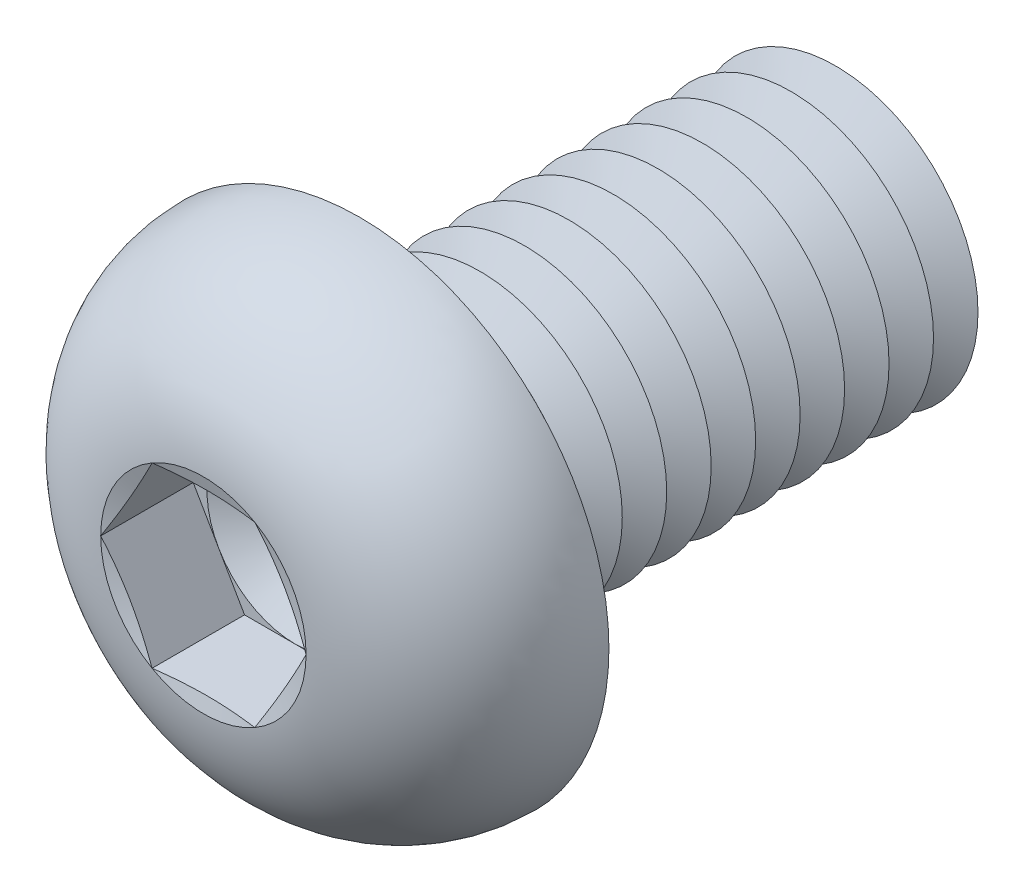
ISO-10303-21;
HEADER;
FILE_DESCRIPTION(('STEP AP214'),'2;1');
FILE_NAME('part.step','',(''),(''),'','','');
FILE_SCHEMA(('AUTOMOTIVE_DESIGN { 1 0 10303 214 1 1 1 1 }'));
ENDSEC;
DATA;
#1=APPLICATION_CONTEXT('core data for automotive mechanical design processes');
#2=APPLICATION_PROTOCOL_DEFINITION('international standard','automotive_design',2000,#1);
#3=PRODUCT_CONTEXT('',#1,'mechanical');
#4=PRODUCT('Part','Part','',(#3));
#5=PRODUCT_RELATED_PRODUCT_CATEGORY('part','',(#4));
#6=PRODUCT_DEFINITION_FORMATION('','',#4);
#7=PRODUCT_DEFINITION_CONTEXT('part definition',#1,'design');
#8=PRODUCT_DEFINITION('design','',#6,#7);
#9=PRODUCT_DEFINITION_SHAPE('','',#8);
#10=(LENGTH_UNIT() NAMED_UNIT(*) SI_UNIT(.MILLI.,.METRE.));
#11=(NAMED_UNIT(*) PLANE_ANGLE_UNIT() SI_UNIT($,.RADIAN.));
#12=(NAMED_UNIT(*) SI_UNIT($,.STERADIAN.) SOLID_ANGLE_UNIT());
#13=UNCERTAINTY_MEASURE_WITH_UNIT(LENGTH_MEASURE(1.E-05),#10,'distance_accuracy_value','');
#14=(GEOMETRIC_REPRESENTATION_CONTEXT(3) GLOBAL_UNCERTAINTY_ASSIGNED_CONTEXT((#13)) GLOBAL_UNIT_ASSIGNED_CONTEXT((#10,
#11,#12)) REPRESENTATION_CONTEXT('',''));
#15=CARTESIAN_POINT('',(0.,0.,0.));
#16=DIRECTION('',(0.,0.,1.));
#17=DIRECTION('',(1.,0.,0.));
#18=AXIS2_PLACEMENT_3D('',#15,#16,#17);
#19=CARTESIAN_POINT('',(0.,0.,1.8));
#20=DIRECTION('',(0.,0.,1.));
#21=DIRECTION('',(1.,0.,0.));
#22=AXIS2_PLACEMENT_3D('',#19,#20,#21);
#23=PLANE('',#22);
#24=CARTESIAN_POINT('',(0.,0.,1.8));
#25=DIRECTION('',(0.,0.,1.));
#26=DIRECTION('',(1.,0.,0.));
#27=AXIS2_PLACEMENT_3D('',#24,#25,#26);
#28=CIRCLE('',#27,2.49999883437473);
#29=CARTESIAN_POINT('',(2.1650625,1.24999941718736,1.8));
#30=VERTEX_POINT('',#29);
#31=CARTESIAN_POINT('',(0.,2.49999883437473,1.8));
#32=VERTEX_POINT('',#31);
#33=EDGE_CURVE('E118',#30,#32,#28,.T.);
#34=ORIENTED_EDGE('',*,*,#33,.F.);
#35=DIRECTION('',(-0.5,0.866025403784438,0.));
#36=VECTOR('',#35,1.);
#37=CARTESIAN_POINT('',(2.88675,0.,1.8));
#38=LINE('',#37,#36);
#39=CARTESIAN_POINT('',(1.443375,2.49999883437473,1.8));
#40=VERTEX_POINT('',#39);
#41=EDGE_CURVE('E125',#30,#40,#38,.T.);
#42=ORIENTED_EDGE('',*,*,#41,.T.);
#43=DIRECTION('',(-1.,0.,0.));
#44=VECTOR('',#43,1.);
#45=CARTESIAN_POINT('',(1.443375,2.49999883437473,1.8));
#46=LINE('',#45,#44);
#47=EDGE_CURVE('E136',#40,#32,#46,.T.);
#48=ORIENTED_EDGE('',*,*,#47,.T.);
#49=EDGE_LOOP('',(#34,#42,#48));
#50=FACE_BOUND('',#49,.T.);
#51=ADVANCED_FACE('F39',(#50),#23,.T.);
#52=CARTESIAN_POINT('',(0.,0.,1.8));
#53=DIRECTION('',(0.,0.,1.));
#54=DIRECTION('',(1.,0.,0.));
#55=AXIS2_PLACEMENT_3D('',#52,#53,#54);
#56=CIRCLE('',#55,2.49999883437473);
#57=CARTESIAN_POINT('',(-2.1650625,1.24999941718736,1.8));
#58=VERTEX_POINT('',#57);
#59=EDGE_CURVE('E11',#32,#58,#56,.T.);
#60=ORIENTED_EDGE('',*,*,#59,.F.);
#61=CARTESIAN_POINT('',(-1.443375,2.49999883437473,1.8));
#62=VERTEX_POINT('',#61);
#63=EDGE_CURVE('E131',#32,#62,#46,.T.);
#64=ORIENTED_EDGE('',*,*,#63,.T.);
#65=DIRECTION('',(-0.5,-0.866025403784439,0.));
#66=VECTOR('',#65,1.);
#67=CARTESIAN_POINT('',(-1.443375,2.49999883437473,1.8));
#68=LINE('',#67,#66);
#69=EDGE_CURVE('E134',#62,#58,#68,.T.);
#70=ORIENTED_EDGE('',*,*,#69,.T.);
#71=EDGE_LOOP('',(#60,#64,#70));
#72=FACE_BOUND('',#71,.T.);
#73=ADVANCED_FACE('F130',(#72),#23,.T.);
#74=CARTESIAN_POINT('',(-2.1650625,-1.24999941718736,1.8));
#75=VERTEX_POINT('',#74);
#76=EDGE_CURVE('E49',#58,#75,#56,.T.);
#77=ORIENTED_EDGE('',*,*,#76,.F.);
#78=CARTESIAN_POINT('',(-2.88675,0.,1.8));
#79=VERTEX_POINT('',#78);
#80=EDGE_CURVE('E143',#58,#79,#68,.T.);
#81=ORIENTED_EDGE('',*,*,#80,.T.);
#82=DIRECTION('',(0.5,-0.866025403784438,0.));
#83=VECTOR('',#82,1.);
#84=CARTESIAN_POINT('',(-2.88675,0.,1.8));
#85=LINE('',#84,#83);
#86=EDGE_CURVE('E152',#79,#75,#85,.T.);
#87=ORIENTED_EDGE('',*,*,#86,.T.);
#88=EDGE_LOOP('',(#77,#81,#87));
#89=FACE_BOUND('',#88,.T.);
#90=ADVANCED_FACE('F358',(#89),#23,.T.);
#91=CARTESIAN_POINT('',(0.,-2.49999883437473,1.8));
#92=VERTEX_POINT('',#91);
#93=EDGE_CURVE('E343',#75,#92,#56,.T.);
#94=ORIENTED_EDGE('',*,*,#93,.F.);
#95=CARTESIAN_POINT('',(-1.443375,-2.49999883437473,1.8));
#96=VERTEX_POINT('',#95);
#97=EDGE_CURVE('E151',#75,#96,#85,.T.);
#98=ORIENTED_EDGE('',*,*,#97,.T.);
#99=DIRECTION('',(1.,0.,0.));
#100=VECTOR('',#99,1.);
#101=CARTESIAN_POINT('',(-1.443375,-2.49999883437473,1.8));
#102=LINE('',#101,#100);
#103=EDGE_CURVE('E157',#96,#92,#102,.T.);
#104=ORIENTED_EDGE('',*,*,#103,.T.);
#105=EDGE_LOOP('',(#94,#98,#104));
#106=FACE_BOUND('',#105,.T.);
#107=ADVANCED_FACE('F351',(#106),#23,.T.);
#108=CARTESIAN_POINT('',(2.1650625,-1.24999941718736,1.8));
#109=VERTEX_POINT('',#108);
#110=EDGE_CURVE('E56',#92,#109,#56,.T.);
#111=ORIENTED_EDGE('',*,*,#110,.F.);
#112=CARTESIAN_POINT('',(1.443375,-2.49999883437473,1.8));
#113=VERTEX_POINT('',#112);
#114=EDGE_CURVE('E156',#92,#113,#102,.T.);
#115=ORIENTED_EDGE('',*,*,#114,.T.);
#116=DIRECTION('',(0.5,0.866025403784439,0.));
#117=VECTOR('',#116,1.);
#118=CARTESIAN_POINT('',(1.443375,-2.49999883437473,1.8));
#119=LINE('',#118,#117);
#120=EDGE_CURVE('E162',#113,#109,#119,.T.);
#121=ORIENTED_EDGE('',*,*,#120,.T.);
#122=EDGE_LOOP('',(#111,#115,#121));
#123=FACE_BOUND('',#122,.T.);
#124=ADVANCED_FACE('F441',(#123),#23,.T.);
#125=CARTESIAN_POINT('',(0.,0.,4.4));
#126=DIRECTION('',(0.,0.,1.));
#127=DIRECTION('',(1.,0.,0.));
#128=AXIS2_PLACEMENT_3D('',#125,#126,#127);
#129=CONICAL_SURFACE('',#128,2.88675,1.30899693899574);
#130=CARTESIAN_POINT('',(2.88686547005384,-0.000199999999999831,4.40003094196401));
#131=CARTESIAN_POINT('',(2.82691617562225,0.103635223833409,4.3839595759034));
#132=CARTESIAN_POINT('',(2.76685817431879,0.207658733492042,4.36936933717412));
#133=CARTESIAN_POINT('',(2.64653003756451,0.416073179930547,4.3437355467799));
#134=CARTESIAN_POINT('',(2.58625982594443,0.520464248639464,4.33269343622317));
#135=CARTESIAN_POINT('',(2.46587274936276,0.728980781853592,4.31480063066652));
#136=CARTESIAN_POINT('',(2.40575669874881,0.833104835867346,4.3079285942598));
#137=CARTESIAN_POINT('',(2.28544792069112,1.0414857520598,4.29871388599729));
#138=CARTESIAN_POINT('',(2.22525521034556,1.14574258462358,4.29637033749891));
#139=CARTESIAN_POINT('',(2.10486978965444,1.35425624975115,4.29637033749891));
#140=CARTESIAN_POINT('',(2.04467707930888,1.45851308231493,4.29871388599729));
#141=CARTESIAN_POINT('',(1.92436830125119,1.66689399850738,4.3079285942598));
#142=CARTESIAN_POINT('',(1.86425225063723,1.77101805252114,4.31480063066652));
#143=CARTESIAN_POINT('',(1.74386517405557,1.97953458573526,4.33269343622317));
#144=CARTESIAN_POINT('',(1.68359496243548,2.08392565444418,4.3437355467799));
#145=CARTESIAN_POINT('',(1.56326682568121,2.29234010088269,4.36936933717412));
#146=CARTESIAN_POINT('',(1.50320882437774,2.39636361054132,4.3839595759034));
#147=CARTESIAN_POINT('',(1.44325952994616,2.50019883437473,4.40003094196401));
#148=B_SPLINE_CURVE_WITH_KNOTS('',3,(#130,#131,#132,#133,#134,#135,#136,#137,#138,#139,#140,
#141,#142,#143,#144,#145,#146,#147),.UNSPECIFIED.,.F.,.F.,(4,2,2,2,2,2,2,2,4),(0.,
0.362931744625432,0.726010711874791,1.08721550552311,1.44835036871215,1.80948523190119,
2.17069002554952,2.53376899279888,2.89670073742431),.UNSPECIFIED.);
#149=CARTESIAN_POINT('',(2.88675,0.,4.4));
#150=VERTEX_POINT('',#149);
#151=CARTESIAN_POINT('',(1.44337499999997,2.49999883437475,4.4));
#152=VERTEX_POINT('',#151);
#153=EDGE_CURVE('E221',#150,#152,#148,.T.);
#154=ORIENTED_EDGE('',*,*,#153,.F.);
#155=CARTESIAN_POINT('',(0.,0.,4.4));
#156=DIRECTION('',(0.,0.,-1.));
#157=DIRECTION('',(-1.,0.,0.));
#158=AXIS2_PLACEMENT_3D('',#155,#156,#157);
#159=CIRCLE('',#158,2.88675);
#160=EDGE_CURVE('E389',#152,#150,#159,.T.);
#161=ORIENTED_EDGE('',*,*,#160,.F.);
#162=EDGE_LOOP('',(#154,#161));
#163=FACE_BOUND('',#162,.T.);
#164=ADVANCED_FACE('F406',(#163),#129,.F.);
#165=CARTESIAN_POINT('',(1.44325952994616,-2.50019883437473,4.40003094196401));
#166=CARTESIAN_POINT('',(1.50320882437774,-2.39636361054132,4.3839595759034));
#167=CARTESIAN_POINT('',(1.56326682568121,-2.29234010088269,4.36936933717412));
#168=CARTESIAN_POINT('',(1.68359496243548,-2.08392565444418,4.3437355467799));
#169=CARTESIAN_POINT('',(1.74386517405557,-1.97953458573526,4.33269343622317));
#170=CARTESIAN_POINT('',(1.86425225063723,-1.77101805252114,4.31480063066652));
#171=CARTESIAN_POINT('',(1.92436830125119,-1.66689399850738,4.3079285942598));
#172=CARTESIAN_POINT('',(2.04467707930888,-1.45851308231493,4.29871388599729));
#173=CARTESIAN_POINT('',(2.10486978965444,-1.35425624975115,4.29637033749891));
#174=CARTESIAN_POINT('',(2.22525521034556,-1.14574258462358,4.29637033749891));
#175=CARTESIAN_POINT('',(2.28544792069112,-1.0414857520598,4.29871388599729));
#176=CARTESIAN_POINT('',(2.40575669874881,-0.833104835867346,4.3079285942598));
#177=CARTESIAN_POINT('',(2.46587274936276,-0.728980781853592,4.31480063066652));
#178=CARTESIAN_POINT('',(2.58625982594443,-0.520464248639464,4.33269343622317));
#179=CARTESIAN_POINT('',(2.64653003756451,-0.416073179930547,4.3437355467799));
#180=CARTESIAN_POINT('',(2.76685817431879,-0.207658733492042,4.36936933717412));
#181=CARTESIAN_POINT('',(2.82691617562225,-0.103635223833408,4.3839595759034));
#182=CARTESIAN_POINT('',(2.88686547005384,0.000200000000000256,4.40003094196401));
#183=B_SPLINE_CURVE_WITH_KNOTS('',3,(#165,#166,#167,#168,#169,#170,#171,#172,#173,#174,#175,
#176,#177,#178,#179,#180,#181,#182),.UNSPECIFIED.,.F.,.F.,(4,2,2,2,2,2,2,2,4),(0.,
0.362931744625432,0.726010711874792,1.08721550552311,1.44835036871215,1.80948523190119,
2.17069002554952,2.53376899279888,2.89670073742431),.UNSPECIFIED.);
#184=CARTESIAN_POINT('',(1.443375,-2.49999883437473,4.4));
#185=VERTEX_POINT('',#184);
#186=EDGE_CURVE('E230',#185,#150,#183,.T.);
#187=ORIENTED_EDGE('',*,*,#186,.F.);
#188=EDGE_CURVE('E392',#150,#185,#159,.T.);
#189=ORIENTED_EDGE('',*,*,#188,.F.);
#190=EDGE_LOOP('',(#187,#189));
#191=FACE_BOUND('',#190,.T.);
#192=ADVANCED_FACE('F409',(#191),#129,.F.);
#193=CARTESIAN_POINT('',(-4.35611719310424,-2.49999883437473,4.97227902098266));
#194=CARTESIAN_POINT('',(-4.25066509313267,-2.49999883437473,4.94777440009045));
#195=CARTESIAN_POINT('',(-4.14516541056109,-2.49999883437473,4.92347459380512));
#196=CARTESIAN_POINT('',(-3.93405094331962,-2.49999883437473,4.87537247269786));
#197=CARTESIAN_POINT('',(-3.82843615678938,-2.49999883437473,4.85157016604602));
#198=CARTESIAN_POINT('',(-3.5113534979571,-2.49999883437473,4.78103338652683));
#199=CARTESIAN_POINT('',(-3.29968815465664,-2.49999883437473,4.73517861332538));
#200=CARTESIAN_POINT('',(-2.87365524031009,-2.49999883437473,4.64645582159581));
#201=CARTESIAN_POINT('',(-2.65928093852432,-2.49999883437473,4.60361983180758));
#202=CARTESIAN_POINT('',(-2.22952626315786,-2.49999883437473,4.52311285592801));
#203=CARTESIAN_POINT('',(-2.01414580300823,-2.49999883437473,4.48544232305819));
#204=CARTESIAN_POINT('',(-1.58798319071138,-2.49999883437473,4.41876559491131));
#205=CARTESIAN_POINT('',(-1.37723418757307,-2.49999883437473,4.38955265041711));
#206=CARTESIAN_POINT('',(-0.954530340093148,-2.49999883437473,4.34171384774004));
#207=CARTESIAN_POINT('',(-0.742575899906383,-2.49999883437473,4.32308463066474));
#208=CARTESIAN_POINT('',(-0.424544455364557,-2.49999883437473,4.30539140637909));
#209=CARTESIAN_POINT('',(-0.318745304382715,-2.49999883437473,4.30120018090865));
#210=CARTESIAN_POINT('',(-0.107062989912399,-2.49999883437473,4.29638997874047));
#211=CARTESIAN_POINT('',(-0.00117982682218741,-2.49999883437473,4.29577098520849));
#212=CARTESIAN_POINT('',(0.210552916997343,-2.49999883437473,4.29814378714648));
#213=CARTESIAN_POINT('',(0.316402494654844,-2.49999883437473,4.30113585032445));
#214=CARTESIAN_POINT('',(0.527944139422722,-2.49999883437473,4.31057322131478));
#215=CARTESIAN_POINT('',(0.633636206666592,-2.49999883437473,4.31701852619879));
#216=CARTESIAN_POINT('',(0.890304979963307,-2.49999883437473,4.33652018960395));
#217=CARTESIAN_POINT('',(1.0411561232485,-2.49999883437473,4.35122885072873));
#218=CARTESIAN_POINT('',(1.34222474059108,-2.49999883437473,4.38593609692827));
#219=CARTESIAN_POINT('',(1.49244223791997,-2.49999883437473,4.40593448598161));
#220=CARTESIAN_POINT('',(1.79273634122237,-2.49999883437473,4.45011321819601));
#221=CARTESIAN_POINT('',(1.94281100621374,-2.49999883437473,4.47430656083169));
#222=CARTESIAN_POINT('',(2.24242097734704,-2.49999883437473,4.52583552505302));
#223=CARTESIAN_POINT('',(2.39195625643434,-2.49999883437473,4.55317130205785));
#224=CARTESIAN_POINT('',(2.69364402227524,-2.49999883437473,4.61079781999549));
#225=CARTESIAN_POINT('',(2.8457870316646,-2.49999883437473,4.64113779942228));
#226=CARTESIAN_POINT('',(3.14969016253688,-2.49999883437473,4.70367638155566));
#227=CARTESIAN_POINT('',(3.30145027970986,-2.49999883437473,4.73587500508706));
#228=CARTESIAN_POINT('',(3.60383766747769,-2.49999883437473,4.80150275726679));
#229=CARTESIAN_POINT('',(3.75446660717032,-2.49999883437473,4.83492423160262));
#230=CARTESIAN_POINT('',(4.05546753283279,-2.49999883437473,4.90285814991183));
#231=CARTESIAN_POINT('',(4.2058395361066,-2.49999883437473,4.9373705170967));
#232=CARTESIAN_POINT('',(4.35611719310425,-2.49999883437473,4.97227902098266));
#233=B_SPLINE_CURVE_WITH_KNOTS('',3,(#193,#194,#195,#196,#197,#198,#199,#200,#201,#202,#203,
#204,#205,#206,#207,#208,#209,#210,#211,#212,#213,#214,#215,#216,#217,#218,#219,#220,#221,#222,
#223,#224,#225,#226,#227,#228,#229,#230,#231,#232),.UNSPECIFIED.,.F.,.F.,(4,2,2,2,2,2,2,2,2,2,2,
2,2,2,2,2,2,2,2,4),(0.,0.324785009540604,0.6495753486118,1.29928181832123,1.95507889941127,
2.61093348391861,3.24905289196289,3.88696967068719,4.204563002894,4.5221548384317,
4.83977022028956,5.15738533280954,5.61196030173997,6.06651842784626,6.52251118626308,
6.97852650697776,7.44392737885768,7.90933346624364,8.37220553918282,8.83504510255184),.UNSPECIFIED.);
#234=CARTESIAN_POINT('',(-1.443375,-2.49999883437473,4.4));
#235=VERTEX_POINT('',#234);
#236=EDGE_CURVE('E370',#235,#185,#233,.T.);
#237=ORIENTED_EDGE('',*,*,#236,.F.);
#238=EDGE_CURVE('E378',#185,#235,#159,.T.);
#239=ORIENTED_EDGE('',*,*,#238,.F.);
#240=EDGE_LOOP('',(#237,#239));
#241=FACE_BOUND('',#240,.T.);
#242=ADVANCED_FACE('F413',(#241),#129,.F.);
#243=CARTESIAN_POINT('',(-2.88686547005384,0.000200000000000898,4.40003094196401));
#244=CARTESIAN_POINT('',(-2.82691617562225,-0.103635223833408,4.3839595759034));
#245=CARTESIAN_POINT('',(-2.76685817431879,-0.207658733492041,4.36936933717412));
#246=CARTESIAN_POINT('',(-2.64653003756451,-0.416073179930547,4.3437355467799));
#247=CARTESIAN_POINT('',(-2.58625982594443,-0.520464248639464,4.33269343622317));
#248=CARTESIAN_POINT('',(-2.46587274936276,-0.728980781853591,4.31480063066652));
#249=CARTESIAN_POINT('',(-2.40575669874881,-0.833104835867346,4.3079285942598));
#250=CARTESIAN_POINT('',(-2.28544792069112,-1.0414857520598,4.29871388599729));
#251=CARTESIAN_POINT('',(-2.22525521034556,-1.14574258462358,4.29637033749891));
#252=CARTESIAN_POINT('',(-2.10486978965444,-1.35425624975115,4.29637033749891));
#253=CARTESIAN_POINT('',(-2.04467707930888,-1.45851308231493,4.29871388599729));
#254=CARTESIAN_POINT('',(-1.92436830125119,-1.66689399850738,4.3079285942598));
#255=CARTESIAN_POINT('',(-1.86425225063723,-1.77101805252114,4.31480063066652));
#256=CARTESIAN_POINT('',(-1.74386517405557,-1.97953458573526,4.33269343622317));
#257=CARTESIAN_POINT('',(-1.68359496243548,-2.08392565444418,4.3437355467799));
#258=CARTESIAN_POINT('',(-1.56326682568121,-2.29234010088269,4.36936933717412));
#259=CARTESIAN_POINT('',(-1.50320882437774,-2.39636361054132,4.3839595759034));
#260=CARTESIAN_POINT('',(-1.44325952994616,-2.50019883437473,4.40003094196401));
#261=B_SPLINE_CURVE_WITH_KNOTS('',3,(#243,#244,#245,#246,#247,#248,#249,#250,#251,#252,#253,
#254,#255,#256,#257,#258,#259,#260),.UNSPECIFIED.,.F.,.F.,(4,2,2,2,2,2,2,2,4),(0.,
0.362931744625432,0.726010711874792,1.08721550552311,1.44835036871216,1.8094852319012,
2.17069002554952,2.53376899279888,2.89670073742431),.UNSPECIFIED.);
#262=CARTESIAN_POINT('',(-2.88675,0.,4.4));
#263=VERTEX_POINT('',#262);
#264=EDGE_CURVE('E363',#263,#235,#261,.T.);
#265=ORIENTED_EDGE('',*,*,#264,.F.);
#266=EDGE_CURVE('E324',#235,#263,#159,.T.);
#267=ORIENTED_EDGE('',*,*,#266,.F.);
#268=EDGE_LOOP('',(#265,#267));
#269=FACE_BOUND('',#268,.T.);
#270=ADVANCED_FACE('F367',(#269),#129,.F.);
#271=CARTESIAN_POINT('',(-1.44325952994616,2.50019883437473,4.40003094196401));
#272=CARTESIAN_POINT('',(-1.50320882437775,2.39636361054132,4.3839595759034));
#273=CARTESIAN_POINT('',(-1.56326682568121,2.29234010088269,4.36936933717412));
#274=CARTESIAN_POINT('',(-1.68359496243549,2.08392565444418,4.3437355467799));
#275=CARTESIAN_POINT('',(-1.74386517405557,1.97953458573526,4.33269343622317));
#276=CARTESIAN_POINT('',(-1.86425225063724,1.77101805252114,4.31480063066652));
#277=CARTESIAN_POINT('',(-1.92436830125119,1.66689399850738,4.3079285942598));
#278=CARTESIAN_POINT('',(-2.04467707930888,1.45851308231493,4.29871388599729));
#279=CARTESIAN_POINT('',(-2.10486978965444,1.35425624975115,4.29637033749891));
#280=CARTESIAN_POINT('',(-2.22525521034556,1.14574258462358,4.29637033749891));
#281=CARTESIAN_POINT('',(-2.28544792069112,1.0414857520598,4.29871388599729));
#282=CARTESIAN_POINT('',(-2.40575669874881,0.833104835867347,4.3079285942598));
#283=CARTESIAN_POINT('',(-2.46587274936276,0.728980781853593,4.31480063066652));
#284=CARTESIAN_POINT('',(-2.58625982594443,0.520464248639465,4.33269343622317));
#285=CARTESIAN_POINT('',(-2.64653003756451,0.416073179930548,4.3437355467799));
#286=CARTESIAN_POINT('',(-2.76685817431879,0.207658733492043,4.36936933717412));
#287=CARTESIAN_POINT('',(-2.82691617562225,0.10363522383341,4.3839595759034));
#288=CARTESIAN_POINT('',(-2.88686547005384,-0.000199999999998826,4.40003094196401));
#289=B_SPLINE_CURVE_WITH_KNOTS('',3,(#271,#272,#273,#274,#275,#276,#277,#278,#279,#280,#281,
#282,#283,#284,#285,#286,#287,#288),.UNSPECIFIED.,.F.,.F.,(4,2,2,2,2,2,2,2,4),(0.,
0.362931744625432,0.726010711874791,1.08721550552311,1.44835036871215,1.80948523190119,
2.17069002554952,2.53376899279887,2.89670073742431),.UNSPECIFIED.);
#290=CARTESIAN_POINT('',(-1.443375,2.49999883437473,4.4));
#291=VERTEX_POINT('',#290);
#292=EDGE_CURVE('E194',#291,#263,#289,.T.);
#293=ORIENTED_EDGE('',*,*,#292,.F.);
#294=EDGE_CURVE('E325',#263,#291,#159,.T.);
#295=ORIENTED_EDGE('',*,*,#294,.F.);
#296=EDGE_LOOP('',(#293,#295));
#297=FACE_BOUND('',#296,.T.);
#298=ADVANCED_FACE('F381',(#297),#129,.F.);
#299=CARTESIAN_POINT('',(0.,0.,-9.625));
#300=DIRECTION('',(0.,0.,1.));
#301=DIRECTION('',(1.,0.,0.));
#302=AXIS2_PLACEMENT_3D('',#299,#300,#301);
#303=CONICAL_SURFACE('',#302,4.,1.0471975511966);
#304=CARTESIAN_POINT('',(0.,0.,-10.25));
#305=DIRECTION('',(0.,0.,1.));
#306=DIRECTION('',(1.,0.,0.));
#307=AXIS2_PLACEMENT_3D('',#304,#305,#306);
#308=CIRCLE('',#307,2.91746824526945);
#309=CARTESIAN_POINT('',(2.91746824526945,0.,-10.25));
#310=VERTEX_POINT('',#309);
#311=EDGE_CURVE('E296',#310,#310,#308,.T.);
#312=ORIENTED_EDGE('',*,*,#311,.T.);
#313=EDGE_LOOP('',(#312));
#314=FACE_BOUND('',#313,.T.);
#315=CARTESIAN_POINT('',(0.,0.,-9.62499999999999));
#316=DIRECTION('',(0.,0.,1.));
#317=DIRECTION('',(1.,0.,0.));
#318=AXIS2_PLACEMENT_3D('',#315,#316,#317);
#319=CIRCLE('',#318,4.);
#320=CARTESIAN_POINT('',(4.,0.,-9.62499999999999));
#321=VERTEX_POINT('',#320);
#322=EDGE_CURVE('E292',#321,#321,#319,.T.);
#323=ORIENTED_EDGE('',*,*,#322,.F.);
#324=EDGE_LOOP('',(#323));
#325=FACE_BOUND('',#324,.T.);
#326=ADVANCED_FACE('F571',(#314,#325),#303,.T.);
#327=CARTESIAN_POINT('',(0.,0.,-10.25));
#328=DIRECTION('',(0.,0.,-1.));
#329=DIRECTION('',(-1.,0.,0.));
#330=AXIS2_PLACEMENT_3D('',#327,#328,#329);
#331=CONICAL_SURFACE('',#330,2.91746824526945,1.0471975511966);
#332=CARTESIAN_POINT('',(0.,0.,-10.875));
#333=DIRECTION('',(0.,0.,1.));
#334=DIRECTION('',(1.,0.,0.));
#335=AXIS2_PLACEMENT_3D('',#332,#333,#334);
#336=CIRCLE('',#335,4.);
#337=CARTESIAN_POINT('',(4.,0.,-10.875));
#338=VERTEX_POINT('',#337);
#339=EDGE_CURVE('E300',#338,#338,#336,.T.);
#340=ORIENTED_EDGE('',*,*,#339,.T.);
#341=EDGE_LOOP('',(#340));
#342=FACE_BOUND('',#341,.T.);
#343=ORIENTED_EDGE('',*,*,#311,.F.);
#344=EDGE_LOOP('',(#343));
#345=FACE_BOUND('',#344,.T.);
#346=ADVANCED_FACE('F754',(#342,#345),#331,.T.);
#347=CARTESIAN_POINT('',(0.,4.00000000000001,-14.));
#348=DIRECTION('',(0.,0.,-1.));
#349=DIRECTION('',(-1.,0.,0.));
#350=AXIS2_PLACEMENT_3D('',#347,#348,#349);
#351=PLANE('',#350);
#352=CARTESIAN_POINT('',(0.,0.,-14.));
#353=DIRECTION('',(0.,0.,1.));
#354=DIRECTION('',(1.,0.,0.));
#355=AXIS2_PLACEMENT_3D('',#352,#353,#354);
#356=CIRCLE('',#355,2.91746824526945);
#357=CARTESIAN_POINT('',(2.91746824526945,0.,-14.));
#358=VERTEX_POINT('',#357);
#359=EDGE_CURVE('E320',#358,#358,#356,.T.);
#360=ORIENTED_EDGE('',*,*,#359,.F.);
#361=EDGE_LOOP('',(#360));
#362=FACE_BOUND('',#361,.T.);
#363=ADVANCED_FACE('F759',(#362),#351,.T.);
#364=CARTESIAN_POINT('',(0.,0.,-13.375));
#365=DIRECTION('',(0.,0.,1.));
#366=DIRECTION('',(1.,0.,0.));
#367=AXIS2_PLACEMENT_3D('',#364,#365,#366);
#368=CONICAL_SURFACE('',#367,4.,1.0471975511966);
#369=ORIENTED_EDGE('',*,*,#359,.T.);
#370=EDGE_LOOP('',(#369));
#371=FACE_BOUND('',#370,.T.);
#372=CARTESIAN_POINT('',(0.,0.,-13.375));
#373=DIRECTION('',(0.,0.,1.));
#374=DIRECTION('',(1.,0.,0.));
#375=AXIS2_PLACEMENT_3D('',#372,#373,#374);
#376=CIRCLE('',#375,4.);
#377=CARTESIAN_POINT('',(4.,0.,-13.375));
#378=VERTEX_POINT('',#377);
#379=EDGE_CURVE('E316',#378,#378,#376,.T.);
#380=ORIENTED_EDGE('',*,*,#379,.F.);
#381=EDGE_LOOP('',(#380));
#382=FACE_BOUND('',#381,.T.);
#383=ADVANCED_FACE('F748',(#371,#382),#368,.T.);
#384=CARTESIAN_POINT('',(0.,0.,-12.75));
#385=DIRECTION('',(0.,0.,-1.));
#386=DIRECTION('',(-1.,0.,0.));
#387=AXIS2_PLACEMENT_3D('',#384,#385,#386);
#388=CONICAL_SURFACE('',#387,2.91746824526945,1.0471975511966);
#389=ORIENTED_EDGE('',*,*,#379,.T.);
#390=EDGE_LOOP('',(#389));
#391=FACE_BOUND('',#390,.T.);
#392=CARTESIAN_POINT('',(0.,0.,-12.75));
#393=DIRECTION('',(0.,0.,1.));
#394=DIRECTION('',(1.,0.,0.));
#395=AXIS2_PLACEMENT_3D('',#392,#393,#394);
#396=CIRCLE('',#395,2.91746824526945);
#397=CARTESIAN_POINT('',(2.91746824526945,0.,-12.75));
#398=VERTEX_POINT('',#397);
#399=EDGE_CURVE('E312',#398,#398,#396,.T.);
#400=ORIENTED_EDGE('',*,*,#399,.F.);
#401=EDGE_LOOP('',(#400));
#402=FACE_BOUND('',#401,.T.);
#403=ADVANCED_FACE('F738',(#391,#402),#388,.T.);
#404=CARTESIAN_POINT('',(0.,0.,-12.125));
#405=DIRECTION('',(0.,0.,1.));
#406=DIRECTION('',(1.,0.,0.));
#407=AXIS2_PLACEMENT_3D('',#404,#405,#406);
#408=CONICAL_SURFACE('',#407,4.,1.0471975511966);
#409=ORIENTED_EDGE('',*,*,#399,.T.);
#410=EDGE_LOOP('',(#409));
#411=FACE_BOUND('',#410,.T.);
#412=CARTESIAN_POINT('',(0.,0.,-12.125));
#413=DIRECTION('',(0.,0.,1.));
#414=DIRECTION('',(1.,0.,0.));
#415=AXIS2_PLACEMENT_3D('',#412,#413,#414);
#416=CIRCLE('',#415,4.);
#417=CARTESIAN_POINT('',(4.,0.,-12.125));
#418=VERTEX_POINT('',#417);
#419=EDGE_CURVE('E308',#418,#418,#416,.T.);
#420=ORIENTED_EDGE('',*,*,#419,.F.);
#421=EDGE_LOOP('',(#420));
#422=FACE_BOUND('',#421,.T.);
#423=ADVANCED_FACE('F728',(#411,#422),#408,.T.);
#424=CARTESIAN_POINT('',(0.,0.,-11.5));
#425=DIRECTION('',(0.,0.,-1.));
#426=DIRECTION('',(-1.,0.,0.));
#427=AXIS2_PLACEMENT_3D('',#424,#425,#426);
#428=CONICAL_SURFACE('',#427,2.91746824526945,1.0471975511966);
#429=ORIENTED_EDGE('',*,*,#419,.T.);
#430=EDGE_LOOP('',(#429));
#431=FACE_BOUND('',#430,.T.);
#432=CARTESIAN_POINT('',(0.,0.,-11.5));
#433=DIRECTION('',(0.,0.,1.));
#434=DIRECTION('',(1.,0.,0.));
#435=AXIS2_PLACEMENT_3D('',#432,#433,#434);
#436=CIRCLE('',#435,2.91746824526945);
#437=CARTESIAN_POINT('',(2.91746824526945,0.,-11.5));
#438=VERTEX_POINT('',#437);
#439=EDGE_CURVE('E304',#438,#438,#436,.T.);
#440=ORIENTED_EDGE('',*,*,#439,.F.);
#441=EDGE_LOOP('',(#440));
#442=FACE_BOUND('',#441,.T.);
#443=ADVANCED_FACE('F718',(#431,#442),#428,.T.);
#444=CARTESIAN_POINT('',(0.,0.,-10.875));
#445=DIRECTION('',(0.,0.,1.));
#446=DIRECTION('',(1.,0.,0.));
#447=AXIS2_PLACEMENT_3D('',#444,#445,#446);
#448=CONICAL_SURFACE('',#447,4.,1.0471975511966);
#449=ORIENTED_EDGE('',*,*,#439,.T.);
#450=EDGE_LOOP('',(#449));
#451=FACE_BOUND('',#450,.T.);
#452=ORIENTED_EDGE('',*,*,#339,.F.);
#453=EDGE_LOOP('',(#452));
#454=FACE_BOUND('',#453,.T.);
#455=ADVANCED_FACE('F708',(#451,#454),#448,.T.);
#456=CARTESIAN_POINT('',(0.,0.,-8.375));
#457=DIRECTION('',(0.,0.,1.));
#458=DIRECTION('',(1.,0.,0.));
#459=AXIS2_PLACEMENT_3D('',#456,#457,#458);
#460=CONICAL_SURFACE('',#459,4.,1.0471975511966);
#461=CARTESIAN_POINT('',(0.,0.,-8.99999999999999));
#462=DIRECTION('',(0.,0.,1.));
#463=DIRECTION('',(1.,0.,0.));
#464=AXIS2_PLACEMENT_3D('',#461,#462,#463);
#465=CIRCLE('',#464,2.91746824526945);
#466=CARTESIAN_POINT('',(2.91746824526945,0.,-8.99999999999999));
#467=VERTEX_POINT('',#466);
#468=EDGE_CURVE('E288',#467,#467,#465,.T.);
#469=ORIENTED_EDGE('',*,*,#468,.T.);
#470=EDGE_LOOP('',(#469));
#471=FACE_BOUND('',#470,.T.);
#472=CARTESIAN_POINT('',(0.,0.,-8.37499999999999));
#473=DIRECTION('',(0.,0.,1.));
#474=DIRECTION('',(1.,0.,0.));
#475=AXIS2_PLACEMENT_3D('',#472,#473,#474);
#476=CIRCLE('',#475,4.);
#477=CARTESIAN_POINT('',(4.,0.,-8.37499999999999));
#478=VERTEX_POINT('',#477);
#479=EDGE_CURVE('E284',#478,#478,#476,.T.);
#480=ORIENTED_EDGE('',*,*,#479,.F.);
#481=EDGE_LOOP('',(#480));
#482=FACE_BOUND('',#481,.T.);
#483=ADVANCED_FACE('F698',(#471,#482),#460,.T.);
#484=CARTESIAN_POINT('',(0.,0.,-8.99999999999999));
#485=DIRECTION('',(0.,0.,-1.));
#486=DIRECTION('',(-1.,0.,0.));
#487=AXIS2_PLACEMENT_3D('',#484,#485,#486);
#488=CONICAL_SURFACE('',#487,2.91746824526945,1.0471975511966);
#489=ORIENTED_EDGE('',*,*,#322,.T.);
#490=EDGE_LOOP('',(#489));
#491=FACE_BOUND('',#490,.T.);
#492=ORIENTED_EDGE('',*,*,#468,.F.);
#493=EDGE_LOOP('',(#492));
#494=FACE_BOUND('',#493,.T.);
#495=ADVANCED_FACE('F688',(#491,#494),#488,.T.);
#496=CARTESIAN_POINT('',(0.,0.,-7.125));
#497=DIRECTION('',(0.,0.,1.));
#498=DIRECTION('',(1.,0.,0.));
#499=AXIS2_PLACEMENT_3D('',#496,#497,#498);
#500=CONICAL_SURFACE('',#499,4.,1.0471975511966);
#501=CARTESIAN_POINT('',(0.,0.,-7.74999999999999));
#502=DIRECTION('',(0.,0.,1.));
#503=DIRECTION('',(1.,0.,0.));
#504=AXIS2_PLACEMENT_3D('',#501,#502,#503);
#505=CIRCLE('',#504,2.91746824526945);
#506=CARTESIAN_POINT('',(2.91746824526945,0.,-7.74999999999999));
#507=VERTEX_POINT('',#506);
#508=EDGE_CURVE('E280',#507,#507,#505,.T.);
#509=ORIENTED_EDGE('',*,*,#508,.T.);
#510=EDGE_LOOP('',(#509));
#511=FACE_BOUND('',#510,.T.);
#512=CARTESIAN_POINT('',(0.,0.,-7.125));
#513=DIRECTION('',(0.,0.,1.));
#514=DIRECTION('',(1.,0.,0.));
#515=AXIS2_PLACEMENT_3D('',#512,#513,#514);
#516=CIRCLE('',#515,4.);
#517=CARTESIAN_POINT('',(4.,0.,-7.125));
#518=VERTEX_POINT('',#517);
#519=EDGE_CURVE('E276',#518,#518,#516,.T.);
#520=ORIENTED_EDGE('',*,*,#519,.F.);
#521=EDGE_LOOP('',(#520));
#522=FACE_BOUND('',#521,.T.);
#523=ADVANCED_FACE('F678',(#511,#522),#500,.T.);
#524=CARTESIAN_POINT('',(0.,0.,-7.74999999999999));
#525=DIRECTION('',(0.,0.,-1.));
#526=DIRECTION('',(-1.,0.,0.));
#527=AXIS2_PLACEMENT_3D('',#524,#525,#526);
#528=CONICAL_SURFACE('',#527,2.91746824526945,1.0471975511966);
#529=ORIENTED_EDGE('',*,*,#479,.T.);
#530=EDGE_LOOP('',(#529));
#531=FACE_BOUND('',#530,.T.);
#532=ORIENTED_EDGE('',*,*,#508,.F.);
#533=EDGE_LOOP('',(#532));
#534=FACE_BOUND('',#533,.T.);
#535=ADVANCED_FACE('F668',(#531,#534),#528,.T.);
#536=CARTESIAN_POINT('',(0.,0.,-5.875));
#537=DIRECTION('',(0.,0.,1.));
#538=DIRECTION('',(1.,0.,0.));
#539=AXIS2_PLACEMENT_3D('',#536,#537,#538);
#540=CONICAL_SURFACE('',#539,4.,1.0471975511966);
#541=CARTESIAN_POINT('',(0.,0.,-6.5));
#542=DIRECTION('',(0.,0.,1.));
#543=DIRECTION('',(1.,0.,0.));
#544=AXIS2_PLACEMENT_3D('',#541,#542,#543);
#545=CIRCLE('',#544,2.91746824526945);
#546=CARTESIAN_POINT('',(2.91746824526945,0.,-6.5));
#547=VERTEX_POINT('',#546);
#548=EDGE_CURVE('E272',#547,#547,#545,.T.);
#549=ORIENTED_EDGE('',*,*,#548,.T.);
#550=EDGE_LOOP('',(#549));
#551=FACE_BOUND('',#550,.T.);
#552=CARTESIAN_POINT('',(0.,0.,-5.87499999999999));
#553=DIRECTION('',(0.,0.,1.));
#554=DIRECTION('',(1.,0.,0.));
#555=AXIS2_PLACEMENT_3D('',#552,#553,#554);
#556=CIRCLE('',#555,4.);
#557=CARTESIAN_POINT('',(4.,0.,-5.87499999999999));
#558=VERTEX_POINT('',#557);
#559=EDGE_CURVE('E268',#558,#558,#556,.T.);
#560=ORIENTED_EDGE('',*,*,#559,.F.);
#561=EDGE_LOOP('',(#560));
#562=FACE_BOUND('',#561,.T.);
#563=ADVANCED_FACE('F658',(#551,#562),#540,.T.);
#564=CARTESIAN_POINT('',(0.,0.,-6.5));
#565=DIRECTION('',(0.,0.,-1.));
#566=DIRECTION('',(-1.,0.,0.));
#567=AXIS2_PLACEMENT_3D('',#564,#565,#566);
#568=CONICAL_SURFACE('',#567,2.91746824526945,1.0471975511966);
#569=ORIENTED_EDGE('',*,*,#519,.T.);
#570=EDGE_LOOP('',(#569));
#571=FACE_BOUND('',#570,.T.);
#572=ORIENTED_EDGE('',*,*,#548,.F.);
#573=EDGE_LOOP('',(#572));
#574=FACE_BOUND('',#573,.T.);
#575=ADVANCED_FACE('F648',(#571,#574),#568,.T.);
#576=CARTESIAN_POINT('',(0.,0.,-4.625));
#577=DIRECTION('',(0.,0.,1.));
#578=DIRECTION('',(1.,0.,0.));
#579=AXIS2_PLACEMENT_3D('',#576,#577,#578);
#580=CONICAL_SURFACE('',#579,4.,1.0471975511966);
#581=CARTESIAN_POINT('',(0.,0.,-5.24999999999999));
#582=DIRECTION('',(0.,0.,1.));
#583=DIRECTION('',(1.,0.,0.));
#584=AXIS2_PLACEMENT_3D('',#581,#582,#583);
#585=CIRCLE('',#584,2.91746824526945);
#586=CARTESIAN_POINT('',(2.91746824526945,0.,-5.24999999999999));
#587=VERTEX_POINT('',#586);
#588=EDGE_CURVE('E264',#587,#587,#585,.T.);
#589=ORIENTED_EDGE('',*,*,#588,.T.);
#590=EDGE_LOOP('',(#589));
#591=FACE_BOUND('',#590,.T.);
#592=CARTESIAN_POINT('',(0.,0.,-4.625));
#593=DIRECTION('',(0.,0.,1.));
#594=DIRECTION('',(1.,0.,0.));
#595=AXIS2_PLACEMENT_3D('',#592,#593,#594);
#596=CIRCLE('',#595,4.);
#597=CARTESIAN_POINT('',(4.,0.,-4.625));
#598=VERTEX_POINT('',#597);
#599=EDGE_CURVE('E260',#598,#598,#596,.T.);
#600=ORIENTED_EDGE('',*,*,#599,.F.);
#601=EDGE_LOOP('',(#600));
#602=FACE_BOUND('',#601,.T.);
#603=ADVANCED_FACE('F638',(#591,#602),#580,.T.);
#604=CARTESIAN_POINT('',(0.,0.,-5.24999999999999));
#605=DIRECTION('',(0.,0.,-1.));
#606=DIRECTION('',(-1.,0.,0.));
#607=AXIS2_PLACEMENT_3D('',#604,#605,#606);
#608=CONICAL_SURFACE('',#607,2.91746824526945,1.0471975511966);
#609=ORIENTED_EDGE('',*,*,#559,.T.);
#610=EDGE_LOOP('',(#609));
#611=FACE_BOUND('',#610,.T.);
#612=ORIENTED_EDGE('',*,*,#588,.F.);
#613=EDGE_LOOP('',(#612));
#614=FACE_BOUND('',#613,.T.);
#615=ADVANCED_FACE('F628',(#611,#614),#608,.T.);
#616=CARTESIAN_POINT('',(0.,0.,-3.375));
#617=DIRECTION('',(0.,0.,1.));
#618=DIRECTION('',(1.,0.,0.));
#619=AXIS2_PLACEMENT_3D('',#616,#617,#618);
#620=CONICAL_SURFACE('',#619,4.,1.0471975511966);
#621=CARTESIAN_POINT('',(0.,0.,-3.99999999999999));
#622=DIRECTION('',(0.,0.,1.));
#623=DIRECTION('',(1.,0.,0.));
#624=AXIS2_PLACEMENT_3D('',#621,#622,#623);
#625=CIRCLE('',#624,2.91746824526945);
#626=CARTESIAN_POINT('',(2.91746824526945,0.,-3.99999999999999));
#627=VERTEX_POINT('',#626);
#628=EDGE_CURVE('E256',#627,#627,#625,.T.);
#629=ORIENTED_EDGE('',*,*,#628,.T.);
#630=EDGE_LOOP('',(#629));
#631=FACE_BOUND('',#630,.T.);
#632=CARTESIAN_POINT('',(0.,0.,-3.375));
#633=DIRECTION('',(0.,0.,1.));
#634=DIRECTION('',(1.,0.,0.));
#635=AXIS2_PLACEMENT_3D('',#632,#633,#634);
#636=CIRCLE('',#635,4.);
#637=CARTESIAN_POINT('',(4.,0.,-3.375));
#638=VERTEX_POINT('',#637);
#639=EDGE_CURVE('E252',#638,#638,#636,.T.);
#640=ORIENTED_EDGE('',*,*,#639,.F.);
#641=EDGE_LOOP('',(#640));
#642=FACE_BOUND('',#641,.T.);
#643=ADVANCED_FACE('F618',(#631,#642),#620,.T.);
#644=CARTESIAN_POINT('',(0.,0.,-3.99999999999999));
#645=DIRECTION('',(0.,0.,-1.));
#646=DIRECTION('',(-1.,0.,0.));
#647=AXIS2_PLACEMENT_3D('',#644,#645,#646);
#648=CONICAL_SURFACE('',#647,2.91746824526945,1.0471975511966);
#649=ORIENTED_EDGE('',*,*,#599,.T.);
#650=EDGE_LOOP('',(#649));
#651=FACE_BOUND('',#650,.T.);
#652=ORIENTED_EDGE('',*,*,#628,.F.);
#653=EDGE_LOOP('',(#652));
#654=FACE_BOUND('',#653,.T.);
#655=ADVANCED_FACE('F608',(#651,#654),#648,.T.);
#656=CARTESIAN_POINT('',(0.,0.,-2.125));
#657=DIRECTION('',(0.,0.,1.));
#658=DIRECTION('',(1.,0.,0.));
#659=AXIS2_PLACEMENT_3D('',#656,#657,#658);
#660=CONICAL_SURFACE('',#659,4.,1.0471975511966);
#661=CARTESIAN_POINT('',(0.,0.,-2.75));
#662=DIRECTION('',(0.,0.,1.));
#663=DIRECTION('',(1.,0.,0.));
#664=AXIS2_PLACEMENT_3D('',#661,#662,#663);
#665=CIRCLE('',#664,2.91746824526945);
#666=CARTESIAN_POINT('',(2.91746824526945,0.,-2.75));
#667=VERTEX_POINT('',#666);
#668=EDGE_CURVE('E248',#667,#667,#665,.T.);
#669=ORIENTED_EDGE('',*,*,#668,.T.);
#670=EDGE_LOOP('',(#669));
#671=FACE_BOUND('',#670,.T.);
#672=CARTESIAN_POINT('',(0.,0.,-2.125));
#673=DIRECTION('',(0.,0.,1.));
#674=DIRECTION('',(1.,0.,0.));
#675=AXIS2_PLACEMENT_3D('',#672,#673,#674);
#676=CIRCLE('',#675,4.);
#677=CARTESIAN_POINT('',(4.,0.,-2.125));
#678=VERTEX_POINT('',#677);
#679=EDGE_CURVE('E240',#678,#678,#676,.T.);
#680=ORIENTED_EDGE('',*,*,#679,.F.);
#681=EDGE_LOOP('',(#680));
#682=FACE_BOUND('',#681,.T.);
#683=ADVANCED_FACE('F598',(#671,#682),#660,.T.);
#684=CARTESIAN_POINT('',(0.,0.,-2.75));
#685=DIRECTION('',(0.,0.,-1.));
#686=DIRECTION('',(-1.,0.,0.));
#687=AXIS2_PLACEMENT_3D('',#684,#685,#686);
#688=CONICAL_SURFACE('',#687,2.91746824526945,1.0471975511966);
#689=ORIENTED_EDGE('',*,*,#639,.T.);
#690=EDGE_LOOP('',(#689));
#691=FACE_BOUND('',#690,.T.);
#692=ORIENTED_EDGE('',*,*,#668,.F.);
#693=EDGE_LOOP('',(#692));
#694=FACE_BOUND('',#693,.T.);
#695=ADVANCED_FACE('F589',(#691,#694),#688,.T.);
#696=CARTESIAN_POINT('',(0.,0.,-0.874999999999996));
#697=DIRECTION('',(0.,0.,1.));
#698=DIRECTION('',(1.,0.,0.));
#699=AXIS2_PLACEMENT_3D('',#696,#697,#698);
#700=CONICAL_SURFACE('',#699,4.,1.0471975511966);
#701=CARTESIAN_POINT('',(0.,0.,-1.49999999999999));
#702=DIRECTION('',(0.,0.,1.));
#703=DIRECTION('',(1.,0.,0.));
#704=AXIS2_PLACEMENT_3D('',#701,#702,#703);
#705=CIRCLE('',#704,2.91746824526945);
#706=CARTESIAN_POINT('',(2.91746824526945,0.,-1.49999999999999));
#707=VERTEX_POINT('',#706);
#708=EDGE_CURVE('E229',#707,#707,#705,.T.);
#709=ORIENTED_EDGE('',*,*,#708,.T.);
#710=EDGE_LOOP('',(#709));
#711=FACE_BOUND('',#710,.T.);
#712=CARTESIAN_POINT('',(0.,0.,-0.874999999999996));
#713=DIRECTION('',(0.,0.,1.));
#714=DIRECTION('',(1.,0.,0.));
#715=AXIS2_PLACEMENT_3D('',#712,#713,#714);
#716=CIRCLE('',#715,4.);
#717=CARTESIAN_POINT('',(4.,0.,-0.874999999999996));
#718=VERTEX_POINT('',#717);
#719=EDGE_CURVE('E244',#718,#718,#716,.T.);
#720=ORIENTED_EDGE('',*,*,#719,.F.);
#721=EDGE_LOOP('',(#720));
#722=FACE_BOUND('',#721,.T.);
#723=ADVANCED_FACE('F580',(#711,#722),#700,.T.);
#724=CARTESIAN_POINT('',(0.,0.,-1.49999999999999));
#725=DIRECTION('',(0.,0.,-1.));
#726=DIRECTION('',(-1.,0.,0.));
#727=AXIS2_PLACEMENT_3D('',#724,#725,#726);
#728=CONICAL_SURFACE('',#727,2.91746824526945,1.0471975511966);
#729=ORIENTED_EDGE('',*,*,#679,.T.);
#730=EDGE_LOOP('',(#729));
#731=FACE_BOUND('',#730,.T.);
#732=ORIENTED_EDGE('',*,*,#708,.F.);
#733=EDGE_LOOP('',(#732));
#734=FACE_BOUND('',#733,.T.);
#735=ADVANCED_FACE('F218',(#731,#734),#728,.T.);
#736=CARTESIAN_POINT('',(4.35611719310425,2.49999883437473,4.97227902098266));
#737=CARTESIAN_POINT('',(4.25066509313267,2.49999883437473,4.94777440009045));
#738=CARTESIAN_POINT('',(4.14516541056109,2.49999883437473,4.92347459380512));
#739=CARTESIAN_POINT('',(3.93405094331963,2.49999883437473,4.87537247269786));
#740=CARTESIAN_POINT('',(3.82843615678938,2.49999883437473,4.85157016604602));
#741=CARTESIAN_POINT('',(3.5113534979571,2.49999883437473,4.78103338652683));
#742=CARTESIAN_POINT('',(3.29968815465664,2.49999883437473,4.73517861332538));
#743=CARTESIAN_POINT('',(2.87365524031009,2.49999883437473,4.64645582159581));
#744=CARTESIAN_POINT('',(2.65928093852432,2.49999883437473,4.60361983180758));
#745=CARTESIAN_POINT('',(2.22952626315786,2.49999883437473,4.52311285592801));
#746=CARTESIAN_POINT('',(2.01414580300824,2.49999883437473,4.48544232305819));
#747=CARTESIAN_POINT('',(1.58798319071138,2.49999883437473,4.41876559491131));
#748=CARTESIAN_POINT('',(1.37723418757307,2.49999883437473,4.38955265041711));
#749=CARTESIAN_POINT('',(0.954530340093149,2.49999883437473,4.34171384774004));
#750=CARTESIAN_POINT('',(0.742575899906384,2.49999883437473,4.32308463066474));
#751=CARTESIAN_POINT('',(0.424544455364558,2.49999883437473,4.30539140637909));
#752=CARTESIAN_POINT('',(0.318745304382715,2.49999883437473,4.30120018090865));
#753=CARTESIAN_POINT('',(0.1070629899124,2.49999883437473,4.29638997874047));
#754=CARTESIAN_POINT('',(0.00117982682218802,2.49999883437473,4.29577098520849));
#755=CARTESIAN_POINT('',(-0.210552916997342,2.49999883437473,4.29814378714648));
#756=CARTESIAN_POINT('',(-0.316402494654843,2.49999883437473,4.30113585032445));
#757=CARTESIAN_POINT('',(-0.527944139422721,2.49999883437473,4.31057322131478));
#758=CARTESIAN_POINT('',(-0.633636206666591,2.49999883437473,4.31701852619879));
#759=CARTESIAN_POINT('',(-0.890304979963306,2.49999883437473,4.33652018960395));
#760=CARTESIAN_POINT('',(-1.0411561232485,2.49999883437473,4.35122885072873));
#761=CARTESIAN_POINT('',(-1.34222474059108,2.49999883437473,4.38593609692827));
#762=CARTESIAN_POINT('',(-1.49244223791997,2.49999883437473,4.40593448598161));
#763=CARTESIAN_POINT('',(-1.79273634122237,2.49999883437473,4.45011321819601));
#764=CARTESIAN_POINT('',(-1.94281100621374,2.49999883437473,4.47430656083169));
#765=CARTESIAN_POINT('',(-2.24242097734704,2.49999883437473,4.52583552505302));
#766=CARTESIAN_POINT('',(-2.39195625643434,2.49999883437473,4.55317130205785));
#767=CARTESIAN_POINT('',(-2.69364402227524,2.49999883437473,4.61079781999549));
#768=CARTESIAN_POINT('',(-2.8457870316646,2.49999883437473,4.64113779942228));
#769=CARTESIAN_POINT('',(-3.14969016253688,2.49999883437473,4.70367638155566));
#770=CARTESIAN_POINT('',(-3.30145027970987,2.49999883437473,4.73587500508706));
#771=CARTESIAN_POINT('',(-3.60383766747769,2.49999883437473,4.80150275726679));
#772=CARTESIAN_POINT('',(-3.75446660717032,2.49999883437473,4.83492423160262));
#773=CARTESIAN_POINT('',(-4.05546753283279,2.49999883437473,4.90285814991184));
#774=CARTESIAN_POINT('',(-4.2058395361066,2.49999883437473,4.9373705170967));
#775=CARTESIAN_POINT('',(-4.35611719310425,2.49999883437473,4.97227902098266));
#776=B_SPLINE_CURVE_WITH_KNOTS('',3,(#736,#737,#738,#739,#740,#741,#742,#743,#744,#745,#746,
#747,#748,#749,#750,#751,#752,#753,#754,#755,#756,#757,#758,#759,#760,#761,#762,#763,#764,#765,
#766,#767,#768,#769,#770,#771,#772,#773,#774,#775),.UNSPECIFIED.,.F.,.F.,(4,2,2,2,2,2,2,2,2,2,2,
2,2,2,2,2,2,2,2,4),(0.,0.324785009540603,0.649575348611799,1.29928181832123,1.95507889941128,
2.61093348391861,3.24905289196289,3.88696967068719,4.204563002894,4.5221548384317,
4.83977022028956,5.15738533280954,5.61196030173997,6.06651842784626,6.52251118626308,
6.97852650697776,7.44392737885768,7.90933346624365,8.37220553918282,8.83504510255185),.UNSPECIFIED.);
#777=EDGE_CURVE('E170',#152,#291,#776,.T.);
#778=ORIENTED_EDGE('',*,*,#777,.F.);
#779=EDGE_CURVE('E330',#291,#152,#159,.T.);
#780=ORIENTED_EDGE('',*,*,#779,.F.);
#781=EDGE_LOOP('',(#778,#780));
#782=FACE_BOUND('',#781,.T.);
#783=ADVANCED_FACE('F201',(#782),#129,.F.);
#784=CARTESIAN_POINT('',(0.,0.,0.));
#785=DIRECTION('',(0.,0.,-1.));
#786=DIRECTION('',(-1.,0.,0.));
#787=AXIS2_PLACEMENT_3D('',#784,#785,#786);
#788=DEGENERATE_TOROIDAL_SURFACE('',#787,2.59000479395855,4.40999520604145,.T.);
#789=ORIENTED_EDGE('',*,*,#294,.T.);
#790=ORIENTED_EDGE('',*,*,#779,.T.);
#791=ORIENTED_EDGE('',*,*,#160,.T.);
#792=ORIENTED_EDGE('',*,*,#188,.T.);
#793=ORIENTED_EDGE('',*,*,#238,.T.);
#794=ORIENTED_EDGE('',*,*,#266,.T.);
#795=EDGE_LOOP('',(#789,#790,#791,#792,#793,#794));
#796=FACE_BOUND('',#795,.T.);
#797=CARTESIAN_POINT('',(0.,0.,0.));
#798=DIRECTION('',(0.,0.,-1.));
#799=DIRECTION('',(-1.,0.,0.));
#800=AXIS2_PLACEMENT_3D('',#797,#798,#799);
#801=CIRCLE('',#800,7.);
#802=CARTESIAN_POINT('',(-7.,0.,0.));
#803=VERTEX_POINT('',#802);
#804=EDGE_CURVE('E329',#803,#803,#801,.T.);
#805=ORIENTED_EDGE('',*,*,#804,.F.);
#806=EDGE_LOOP('',(#805));
#807=FACE_BOUND('',#806,.T.);
#808=ADVANCED_FACE('F373',(#796,#807),#788,.T.);
#809=CARTESIAN_POINT('',(0.,4.,0.));
#810=DIRECTION('',(0.,0.,-1.));
#811=DIRECTION('',(-1.,0.,0.));
#812=AXIS2_PLACEMENT_3D('',#809,#810,#811);
#813=PLANE('',#812);
#814=CARTESIAN_POINT('',(0.,0.,0.));
#815=DIRECTION('',(0.,0.,-1.));
#816=DIRECTION('',(-1.,0.,0.));
#817=AXIS2_PLACEMENT_3D('',#814,#815,#816);
#818=CIRCLE('',#817,4.625);
#819=CARTESIAN_POINT('',(-4.625,0.,0.));
#820=VERTEX_POINT('',#819);
#821=EDGE_CURVE('E337',#820,#820,#818,.F.);
#822=ORIENTED_EDGE('',*,*,#821,.T.);
#823=EDGE_LOOP('',(#822));
#824=FACE_BOUND('',#823,.T.);
#825=ORIENTED_EDGE('',*,*,#804,.T.);
#826=EDGE_LOOP('',(#825));
#827=FACE_BOUND('',#826,.T.);
#828=ADVANCED_FACE('F801',(#824,#827),#813,.T.);
#829=CARTESIAN_POINT('',(0.,0.,-0.624999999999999));
#830=DIRECTION('',(0.,0.,-1.));
#831=DIRECTION('',(-1.,0.,0.));
#832=AXIS2_PLACEMENT_3D('',#829,#830,#831);
#833=TOROIDAL_SURFACE('',#832,4.625,0.625);
#834=ORIENTED_EDGE('',*,*,#821,.F.);
#835=EDGE_LOOP('',(#834));
#836=FACE_BOUND('',#835,.T.);
#837=CARTESIAN_POINT('',(0.,0.,-0.624999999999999));
#838=DIRECTION('',(0.,0.,-1.));
#839=DIRECTION('',(-1.,0.,0.));
#840=AXIS2_PLACEMENT_3D('',#837,#838,#839);
#841=CIRCLE('',#840,4.);
#842=CARTESIAN_POINT('',(-4.,0.,-0.624999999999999));
#843=VERTEX_POINT('',#842);
#844=EDGE_CURVE('E334',#843,#843,#841,.T.);
#845=ORIENTED_EDGE('',*,*,#844,.F.);
#846=EDGE_LOOP('',(#845));
#847=FACE_BOUND('',#846,.T.);
#848=ADVANCED_FACE('F41',(#836,#847),#833,.F.);
#849=CARTESIAN_POINT('',(0.,0.,-14.));
#850=DIRECTION('',(0.,0.,-1.));
#851=DIRECTION('',(-1.,0.,0.));
#852=AXIS2_PLACEMENT_3D('',#849,#850,#851);
#853=CYLINDRICAL_SURFACE('',#852,4.);
#854=ORIENTED_EDGE('',*,*,#844,.T.);
#855=EDGE_LOOP('',(#854));
#856=FACE_BOUND('',#855,.T.);
#857=ORIENTED_EDGE('',*,*,#719,.T.);
#858=EDGE_LOOP('',(#857));
#859=FACE_BOUND('',#858,.T.);
#860=ADVANCED_FACE('F216',(#856,#859),#853,.T.);
#861=CARTESIAN_POINT('',(2.88675,0.,1.8));
#862=DIRECTION('',(0.866025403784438,0.5,0.));
#863=DIRECTION('',(-0.5,0.866025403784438,0.));
#864=AXIS2_PLACEMENT_3D('',#861,#862,#863);
#865=PLANE('',#864);
#866=ORIENTED_EDGE('',*,*,#153,.T.);
#867=DIRECTION('',(0.,0.,1.));
#868=VECTOR('',#867,1.);
#869=CARTESIAN_POINT('',(1.443375,2.49999883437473,1.8));
#870=LINE('',#869,#868);
#871=EDGE_CURVE('E64',#40,#152,#870,.T.);
#872=ORIENTED_EDGE('',*,*,#871,.F.);
#873=ORIENTED_EDGE('',*,*,#41,.F.);
#874=CARTESIAN_POINT('',(2.88675,0.,1.8));
#875=VERTEX_POINT('',#874);
#876=EDGE_CURVE('E140',#875,#30,#38,.T.);
#877=ORIENTED_EDGE('',*,*,#876,.F.);
#878=DIRECTION('',(0.,0.,1.));
#879=VECTOR('',#878,1.);
#880=CARTESIAN_POINT('',(2.88675,0.,1.8));
#881=LINE('',#880,#879);
#882=EDGE_CURVE('E166',#875,#150,#881,.T.);
#883=ORIENTED_EDGE('',*,*,#882,.T.);
#884=EDGE_LOOP('',(#866,#872,#873,#877,#883));
#885=FACE_BOUND('',#884,.T.);
#886=ADVANCED_FACE('F211',(#885),#865,.F.);
#887=CARTESIAN_POINT('',(1.443375,-2.49999883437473,1.8));
#888=DIRECTION('',(0.866025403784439,-0.5,0.));
#889=DIRECTION('',(0.5,0.866025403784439,0.));
#890=AXIS2_PLACEMENT_3D('',#887,#888,#889);
#891=PLANE('',#890);
#892=ORIENTED_EDGE('',*,*,#186,.T.);
#893=ORIENTED_EDGE('',*,*,#882,.F.);
#894=EDGE_CURVE('E161',#109,#875,#119,.T.);
#895=ORIENTED_EDGE('',*,*,#894,.F.);
#896=ORIENTED_EDGE('',*,*,#120,.F.);
#897=DIRECTION('',(0.,0.,1.));
#898=VECTOR('',#897,1.);
#899=CARTESIAN_POINT('',(1.443375,-2.49999883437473,1.8));
#900=LINE('',#899,#898);
#901=EDGE_CURVE('E171',#113,#185,#900,.T.);
#902=ORIENTED_EDGE('',*,*,#901,.T.);
#903=EDGE_LOOP('',(#892,#893,#895,#896,#902));
#904=FACE_BOUND('',#903,.T.);
#905=ADVANCED_FACE('F215',(#904),#891,.F.);
#906=CARTESIAN_POINT('',(-1.443375,-2.49999883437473,1.8));
#907=DIRECTION('',(0.,-1.,0.));
#908=DIRECTION('',(1.,0.,0.));
#909=AXIS2_PLACEMENT_3D('',#906,#907,#908);
#910=PLANE('',#909);
#911=ORIENTED_EDGE('',*,*,#236,.T.);
#912=ORIENTED_EDGE('',*,*,#901,.F.);
#913=ORIENTED_EDGE('',*,*,#114,.F.);
#914=ORIENTED_EDGE('',*,*,#103,.F.);
#915=DIRECTION('',(0.,0.,1.));
#916=VECTOR('',#915,1.);
#917=CARTESIAN_POINT('',(-1.443375,-2.49999883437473,1.8));
#918=LINE('',#917,#916);
#919=EDGE_CURVE('E175',#96,#235,#918,.T.);
#920=ORIENTED_EDGE('',*,*,#919,.T.);
#921=EDGE_LOOP('',(#911,#912,#913,#914,#920));
#922=FACE_BOUND('',#921,.T.);
#923=ADVANCED_FACE('F426',(#922),#910,.F.);
#924=CARTESIAN_POINT('',(-2.88675,0.,1.8));
#925=DIRECTION('',(-0.866025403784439,-0.5,0.));
#926=DIRECTION('',(0.5,-0.866025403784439,0.));
#927=AXIS2_PLACEMENT_3D('',#924,#925,#926);
#928=PLANE('',#927);
#929=ORIENTED_EDGE('',*,*,#264,.T.);
#930=ORIENTED_EDGE('',*,*,#919,.F.);
#931=ORIENTED_EDGE('',*,*,#97,.F.);
#932=ORIENTED_EDGE('',*,*,#86,.F.);
#933=DIRECTION('',(0.,0.,1.));
#934=VECTOR('',#933,1.);
#935=CARTESIAN_POINT('',(-2.88675,0.,1.8));
#936=LINE('',#935,#934);
#937=EDGE_CURVE('E179',#79,#263,#936,.T.);
#938=ORIENTED_EDGE('',*,*,#937,.T.);
#939=EDGE_LOOP('',(#929,#930,#931,#932,#938));
#940=FACE_BOUND('',#939,.T.);
#941=ADVANCED_FACE('F356',(#940),#928,.F.);
#942=CARTESIAN_POINT('',(-1.443375,2.49999883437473,1.8));
#943=DIRECTION('',(-0.866025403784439,0.5,0.));
#944=DIRECTION('',(-0.5,-0.866025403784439,0.));
#945=AXIS2_PLACEMENT_3D('',#942,#943,#944);
#946=PLANE('',#945);
#947=ORIENTED_EDGE('',*,*,#292,.T.);
#948=ORIENTED_EDGE('',*,*,#937,.F.);
#949=ORIENTED_EDGE('',*,*,#80,.F.);
#950=ORIENTED_EDGE('',*,*,#69,.F.);
#951=DIRECTION('',(0.,0.,1.));
#952=VECTOR('',#951,1.);
#953=CARTESIAN_POINT('',(-1.443375,2.49999883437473,1.8));
#954=LINE('',#953,#952);
#955=EDGE_CURVE('E138',#62,#291,#954,.T.);
#956=ORIENTED_EDGE('',*,*,#955,.T.);
#957=EDGE_LOOP('',(#947,#948,#949,#950,#956));
#958=FACE_BOUND('',#957,.T.);
#959=ADVANCED_FACE('F208',(#958),#946,.F.);
#960=CARTESIAN_POINT('',(1.443375,2.49999883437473,1.8));
#961=DIRECTION('',(0.,1.,0.));
#962=DIRECTION('',(-1.,0.,0.));
#963=AXIS2_PLACEMENT_3D('',#960,#961,#962);
#964=PLANE('',#963);
#965=ORIENTED_EDGE('',*,*,#777,.T.);
#966=ORIENTED_EDGE('',*,*,#955,.F.);
#967=ORIENTED_EDGE('',*,*,#63,.F.);
#968=ORIENTED_EDGE('',*,*,#47,.F.);
#969=ORIENTED_EDGE('',*,*,#871,.T.);
#970=EDGE_LOOP('',(#965,#966,#967,#968,#969));
#971=FACE_BOUND('',#970,.T.);
#972=ADVANCED_FACE('F135',(#971),#964,.F.);
#973=EDGE_CURVE('E43',#109,#30,#56,.T.);
#974=ORIENTED_EDGE('',*,*,#973,.F.);
#975=ORIENTED_EDGE('',*,*,#894,.T.);
#976=ORIENTED_EDGE('',*,*,#876,.T.);
#977=EDGE_LOOP('',(#974,#975,#976));
#978=FACE_BOUND('',#977,.T.);
#979=ADVANCED_FACE('F115',(#978),#23,.T.);
#980=CARTESIAN_POINT('',(0.,0.,1.8));
#981=DIRECTION('',(0.,0.,1.));
#982=DIRECTION('',(1.,0.,0.));
#983=AXIS2_PLACEMENT_3D('',#980,#981,#982);
#984=CONICAL_SURFACE('',#983,2.49999883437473,1.0471975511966);
#985=CARTESIAN_POINT('',(0.,0.,0.35662500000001));
#986=VERTEX_POINT('',#985);
#987=VERTEX_LOOP('',#986);
#988=FACE_BOUND('',#987,.T.);
#989=ORIENTED_EDGE('',*,*,#33,.T.);
#990=ORIENTED_EDGE('',*,*,#59,.T.);
#991=ORIENTED_EDGE('',*,*,#76,.T.);
#992=ORIENTED_EDGE('',*,*,#93,.T.);
#993=ORIENTED_EDGE('',*,*,#110,.T.);
#994=ORIENTED_EDGE('',*,*,#973,.T.);
#995=EDGE_LOOP('',(#989,#990,#991,#992,#993,#994));
#996=FACE_BOUND('',#995,.T.);
#997=ADVANCED_FACE('F113',(#988,#996),#984,.F.);
#998=CLOSED_SHELL('',(#51,#73,#90,#107,#124,#164,#192,#242,#270,#298,#326,#346,#363,#383,#403,
#423,#443,#455,#483,#495,#523,#535,#563,#575,#603,#615,#643,#655,#683,#695,#723,#735,#783,#808,
#828,#848,#860,#886,#905,#923,#941,#959,#972,#979,#997));
#999=MANIFOLD_SOLID_BREP('B2',#998);
#1000=ADVANCED_BREP_SHAPE_REPRESENTATION('',(#18,#999),#14);
#1001=SHAPE_DEFINITION_REPRESENTATION(#9,#1000);
ENDSEC;
END-ISO-10303-21;
